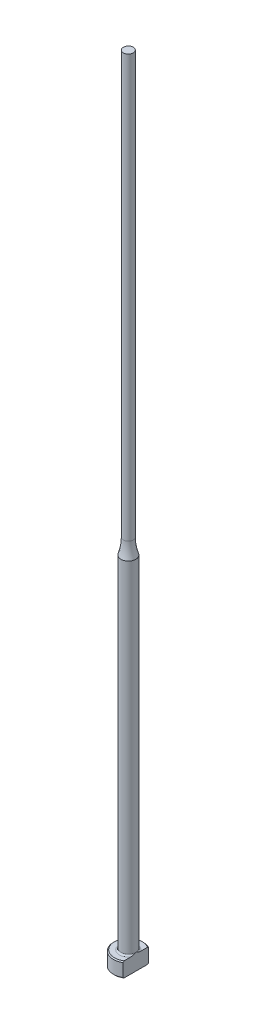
ISO-10303-21;
HEADER;
FILE_DESCRIPTION(('STEP AP214'),'2;1');
FILE_NAME('part.step','',(''),(''),'','','');
FILE_SCHEMA(('AUTOMOTIVE_DESIGN { 1 0 10303 214 1 1 1 1 }'));
ENDSEC;
DATA;
#1=APPLICATION_CONTEXT('core data for automotive mechanical design processes');
#2=APPLICATION_PROTOCOL_DEFINITION('international standard','automotive_design',2000,#1);
#3=PRODUCT_CONTEXT('',#1,'mechanical');
#4=PRODUCT('Part','Part','',(#3));
#5=PRODUCT_RELATED_PRODUCT_CATEGORY('part','',(#4));
#6=PRODUCT_DEFINITION_FORMATION('','',#4);
#7=PRODUCT_DEFINITION_CONTEXT('part definition',#1,'design');
#8=PRODUCT_DEFINITION('design','',#6,#7);
#9=PRODUCT_DEFINITION_SHAPE('','',#8);
#10=(LENGTH_UNIT() NAMED_UNIT(*) SI_UNIT(.MILLI.,.METRE.));
#11=(NAMED_UNIT(*) PLANE_ANGLE_UNIT() SI_UNIT($,.RADIAN.));
#12=(NAMED_UNIT(*) SI_UNIT($,.STERADIAN.) SOLID_ANGLE_UNIT());
#13=UNCERTAINTY_MEASURE_WITH_UNIT(LENGTH_MEASURE(1.E-05),#10,'distance_accuracy_value','');
#14=(GEOMETRIC_REPRESENTATION_CONTEXT(3) GLOBAL_UNCERTAINTY_ASSIGNED_CONTEXT((#13)) GLOBAL_UNIT_ASSIGNED_CONTEXT((#10,
#11,#12)) REPRESENTATION_CONTEXT('',''));
#15=CARTESIAN_POINT('',(0.,0.,0.));
#16=DIRECTION('',(0.,0.,1.));
#17=DIRECTION('',(1.,0.,0.));
#18=AXIS2_PLACEMENT_3D('',#15,#16,#17);
#19=CARTESIAN_POINT('',(-2.99999999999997,3.,0.));
#20=DIRECTION('',(0.,1.,0.));
#21=DIRECTION('',(0.,0.,1.));
#22=AXIS2_PLACEMENT_3D('',#19,#20,#21);
#23=PLANE('',#22);
#24=CARTESIAN_POINT('',(0.,3.,0.));
#25=DIRECTION('',(0.,1.,0.));
#26=DIRECTION('',(0.,0.,1.));
#27=AXIS2_PLACEMENT_3D('',#24,#25,#26);
#28=CIRCLE('',#27,2.79999999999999);
#29=CARTESIAN_POINT('',(1.49999999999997,3.,-2.36431808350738));
#30=VERTEX_POINT('',#29);
#31=CARTESIAN_POINT('',(1.49999999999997,3.,2.36431808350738));
#32=VERTEX_POINT('',#31);
#33=EDGE_CURVE('E187',#30,#32,#28,.T.);
#34=ORIENTED_EDGE('',*,*,#33,.T.);
#35=DIRECTION('',(0.,0.,-1.));
#36=VECTOR('',#35,1.);
#37=CARTESIAN_POINT('',(1.49999999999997,3.,0.));
#38=LINE('',#37,#36);
#39=CARTESIAN_POINT('',(1.49999999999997,3.00000000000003,0.99498743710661));
#40=VERTEX_POINT('',#39);
#41=EDGE_CURVE('E57',#32,#40,#38,.T.);
#42=ORIENTED_EDGE('',*,*,#41,.T.);
#43=CARTESIAN_POINT('',(0.,3.,0.));
#44=DIRECTION('',(0.,1.,0.));
#45=DIRECTION('',(0.,0.,1.));
#46=AXIS2_PLACEMENT_3D('',#43,#44,#45);
#47=CIRCLE('',#46,1.79999999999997);
#48=CARTESIAN_POINT('',(1.49999999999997,3.00000000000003,-0.994987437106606));
#49=VERTEX_POINT('',#48);
#50=EDGE_CURVE('E108',#40,#49,#47,.F.);
#51=ORIENTED_EDGE('',*,*,#50,.T.);
#52=EDGE_CURVE('E137',#49,#30,#38,.T.);
#53=ORIENTED_EDGE('',*,*,#52,.T.);
#54=EDGE_LOOP('',(#34,#42,#51,#53));
#55=FACE_BOUND('',#54,.T.);
#56=ADVANCED_FACE('F32',(#55),#23,.T.);
#57=CARTESIAN_POINT('',(0.,259.958771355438,0.));
#58=DIRECTION('',(0.,1.,0.));
#59=DIRECTION('',(0.,0.,1.));
#60=AXIS2_PLACEMENT_3D('',#57,#58,#59);
#61=CYLINDRICAL_SURFACE('',#60,2.99999999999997);
#62=CARTESIAN_POINT('',(0.,2.80000000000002,0.));
#63=DIRECTION('',(0.,1.,0.));
#64=DIRECTION('',(0.,0.,1.));
#65=AXIS2_PLACEMENT_3D('',#62,#63,#64);
#66=CIRCLE('',#65,2.99999999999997);
#67=CARTESIAN_POINT('',(1.49999999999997,2.80000000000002,2.5980762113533));
#68=VERTEX_POINT('',#67);
#69=CARTESIAN_POINT('',(1.49999999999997,2.80000000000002,-2.5980762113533));
#70=VERTEX_POINT('',#69);
#71=EDGE_CURVE('E105',#68,#70,#66,.F.);
#72=ORIENTED_EDGE('',*,*,#71,.T.);
#73=DIRECTION('',(0.,-1.,0.));
#74=VECTOR('',#73,1.);
#75=CARTESIAN_POINT('',(1.49999999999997,160.,-2.5980762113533));
#76=LINE('',#75,#74);
#77=CARTESIAN_POINT('',(1.49999999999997,0.200000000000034,-2.5980762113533));
#78=VERTEX_POINT('',#77);
#79=EDGE_CURVE('E193',#70,#78,#76,.T.);
#80=ORIENTED_EDGE('',*,*,#79,.T.);
#81=CARTESIAN_POINT('',(0.,0.200000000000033,0.));
#82=DIRECTION('',(0.,-1.,0.));
#83=DIRECTION('',(0.,0.,-1.));
#84=AXIS2_PLACEMENT_3D('',#81,#82,#83);
#85=CIRCLE('',#84,2.99999999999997);
#86=CARTESIAN_POINT('',(1.49999999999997,0.200000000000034,2.5980762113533));
#87=VERTEX_POINT('',#86);
#88=EDGE_CURVE('E100',#78,#87,#85,.F.);
#89=ORIENTED_EDGE('',*,*,#88,.T.);
#90=DIRECTION('',(0.,-1.,0.));
#91=VECTOR('',#90,1.);
#92=CARTESIAN_POINT('',(1.49999999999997,160.,2.5980762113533));
#93=LINE('',#92,#91);
#94=EDGE_CURVE('E93',#68,#87,#93,.T.);
#95=ORIENTED_EDGE('',*,*,#94,.F.);
#96=EDGE_LOOP('',(#72,#80,#89,#95));
#97=FACE_BOUND('',#96,.T.);
#98=ADVANCED_FACE('F158',(#97),#61,.T.);
#99=CARTESIAN_POINT('',(0.,0.,0.));
#100=DIRECTION('',(0.,-1.,0.));
#101=DIRECTION('',(0.,0.,-1.));
#102=AXIS2_PLACEMENT_3D('',#99,#100,#101);
#103=PLANE('',#102);
#104=CARTESIAN_POINT('',(0.,0.,0.));
#105=DIRECTION('',(0.,-1.,0.));
#106=DIRECTION('',(0.,0.,-1.));
#107=AXIS2_PLACEMENT_3D('',#104,#105,#106);
#108=CIRCLE('',#107,2.79999999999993);
#109=CARTESIAN_POINT('',(1.49999999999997,0.,2.36431808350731));
#110=VERTEX_POINT('',#109);
#111=CARTESIAN_POINT('',(1.49999999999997,0.,-2.36431808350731));
#112=VERTEX_POINT('',#111);
#113=EDGE_CURVE('E98',#110,#112,#108,.T.);
#114=ORIENTED_EDGE('',*,*,#113,.T.);
#115=DIRECTION('',(0.,0.,1.));
#116=VECTOR('',#115,1.);
#117=CARTESIAN_POINT('',(1.49999999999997,0.,-2.5980762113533));
#118=LINE('',#117,#116);
#119=EDGE_CURVE('E83',#112,#110,#118,.T.);
#120=ORIENTED_EDGE('',*,*,#119,.T.);
#121=EDGE_LOOP('',(#114,#120));
#122=FACE_BOUND('',#121,.T.);
#123=ADVANCED_FACE('F103',(#122),#103,.T.);
#124=CARTESIAN_POINT('',(0.,3.,0.));
#125=DIRECTION('',(0.,-1.,0.));
#126=DIRECTION('',(0.,0.,-1.));
#127=AXIS2_PLACEMENT_3D('',#124,#125,#126);
#128=CONICAL_SURFACE('',#127,2.79999999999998,0.785398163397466);
#129=ORIENTED_EDGE('',*,*,#71,.F.);
#130=CARTESIAN_POINT('',(1.49999999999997,-0.111741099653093,5.71827621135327));
#131=CARTESIAN_POINT('',(1.49999999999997,0.0136183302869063,5.58866816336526));
#132=CARTESIAN_POINT('',(1.49999999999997,0.138843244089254,5.45892957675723));
#133=CARTESIAN_POINT('',(1.49999999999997,0.388944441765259,5.19911365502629));
#134=CARTESIAN_POINT('',(1.49999999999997,0.513820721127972,5.06903631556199));
#135=CARTESIAN_POINT('',(1.49999999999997,0.763205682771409,4.80840180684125));
#136=CARTESIAN_POINT('',(1.49999999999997,0.887714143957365,4.67784442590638));
#137=CARTESIAN_POINT('',(1.49999999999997,1.13618059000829,4.41620813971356));
#138=CARTESIAN_POINT('',(1.49999999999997,1.26013857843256,4.28512923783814));
#139=CARTESIAN_POINT('',(1.49999999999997,1.50488975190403,4.02490837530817));
#140=CARTESIAN_POINT('',(1.49999999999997,1.6256969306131,3.89577958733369));
#141=CARTESIAN_POINT('',(1.49999999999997,1.86640694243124,3.63668213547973));
#142=CARTESIAN_POINT('',(1.49999999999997,1.98630978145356,3.50671347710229));
#143=CARTESIAN_POINT('',(1.49999999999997,2.22486033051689,3.24567921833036));
#144=CARTESIAN_POINT('',(1.49999999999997,2.34350830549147,3.11461386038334));
#145=CARTESIAN_POINT('',(1.49999999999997,2.57907716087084,2.85094268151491));
#146=CARTESIAN_POINT('',(1.49999999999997,2.69599811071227,2.71833692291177));
#147=CARTESIAN_POINT('',(1.49999999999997,2.88262371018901,2.50255231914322));
#148=CARTESIAN_POINT('',(1.49999999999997,2.95312454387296,2.42006293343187));
#149=CARTESIAN_POINT('',(1.49999999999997,3.0928709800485,2.25401084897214));
#150=CARTESIAN_POINT('',(1.49999999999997,3.16211645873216,2.17044804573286));
#151=CARTESIAN_POINT('',(1.49999999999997,3.29964684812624,2.00105967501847));
#152=CARTESIAN_POINT('',(1.49999999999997,3.36791386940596,1.91521952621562));
#153=CARTESIAN_POINT('',(1.49999999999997,3.50205840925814,1.74171392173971));
#154=CARTESIAN_POINT('',(1.49999999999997,3.56793649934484,1.65404891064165));
#155=CARTESIAN_POINT('',(1.49999999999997,3.69728151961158,1.47490236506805));
#156=CARTESIAN_POINT('',(1.49999999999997,3.76069661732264,1.38338308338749));
#157=CARTESIAN_POINT('',(1.49999999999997,3.8823953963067,1.19675661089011));
#158=CARTESIAN_POINT('',(1.49999999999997,3.94067201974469,1.10164473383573));
#159=CARTESIAN_POINT('',(1.49999999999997,4.04841325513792,0.908008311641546));
#160=CARTESIAN_POINT('',(1.49999999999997,4.0979780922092,0.809540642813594));
#161=CARTESIAN_POINT('',(1.49999999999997,4.18432188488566,0.607192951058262));
#162=CARTESIAN_POINT('',(1.49999999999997,4.22114374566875,0.503332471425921));
#163=CARTESIAN_POINT('',(1.49999999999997,4.26099935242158,0.347577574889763));
#164=CARTESIAN_POINT('',(1.49999999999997,4.27157029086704,0.297609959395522));
#165=CARTESIAN_POINT('',(1.49999999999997,4.28794860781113,0.196885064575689));
#166=CARTESIAN_POINT('',(1.49999999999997,4.29375640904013,0.146127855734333));
#167=CARTESIAN_POINT('',(1.49999999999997,4.30019707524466,0.0444388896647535));
#168=CARTESIAN_POINT('',(1.49999999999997,4.30084594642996,-0.00649183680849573));
#169=CARTESIAN_POINT('',(1.49999999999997,4.29696416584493,-0.108155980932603));
#170=CARTESIAN_POINT('',(1.49999999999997,4.29243308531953,-0.15888938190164));
#171=CARTESIAN_POINT('',(1.49999999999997,4.27856915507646,-0.259234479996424));
#172=CARTESIAN_POINT('',(1.49999999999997,4.26927821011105,-0.30885208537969));
#173=CARTESIAN_POINT('',(1.49999999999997,4.24647108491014,-0.407110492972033));
#174=CARTESIAN_POINT('',(1.49999999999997,4.2329532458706,-0.455750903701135));
#175=CARTESIAN_POINT('',(1.49999999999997,4.20226175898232,-0.552149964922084));
#176=CARTESIAN_POINT('',(1.49999999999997,4.18506801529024,-0.599902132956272));
#177=CARTESIAN_POINT('',(1.49999999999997,4.14771387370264,-0.694205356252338));
#178=CARTESIAN_POINT('',(1.49999999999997,4.1275540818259,-0.740756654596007));
#179=CARTESIAN_POINT('',(1.49999999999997,4.06327696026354,-0.879166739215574));
#180=CARTESIAN_POINT('',(1.49999999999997,4.01551721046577,-0.969329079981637));
#181=CARTESIAN_POINT('',(1.49999999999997,3.91367909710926,-1.1460431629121));
#182=CARTESIAN_POINT('',(1.49999999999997,3.85959300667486,-1.23259031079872));
#183=CARTESIAN_POINT('',(1.49999999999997,3.74697968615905,-1.40321348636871));
#184=CARTESIAN_POINT('',(1.49999999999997,3.68843573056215,-1.48727838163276));
#185=CARTESIAN_POINT('',(1.49999999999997,3.56843845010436,-1.65322187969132));
#186=CARTESIAN_POINT('',(1.49999999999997,3.50698656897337,-1.73510153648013));
#187=CARTESIAN_POINT('',(1.49999999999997,3.38115673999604,-1.89829823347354));
#188=CARTESIAN_POINT('',(1.49999999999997,3.31675092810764,-1.97959369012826));
#189=CARTESIAN_POINT('',(1.49999999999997,3.18634068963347,-2.14090082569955));
#190=CARTESIAN_POINT('',(1.49999999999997,3.12033609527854,-2.22091236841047));
#191=CARTESIAN_POINT('',(1.49999999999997,2.92086431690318,-2.45906508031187));
#192=CARTESIAN_POINT('',(1.49999999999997,2.78562663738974,-2.61572090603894));
#193=CARTESIAN_POINT('',(1.49999999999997,2.53554498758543,-2.90006295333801));
#194=CARTESIAN_POINT('',(1.49999999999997,2.42114543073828,-3.02814382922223));
#195=CARTESIAN_POINT('',(1.49999999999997,2.19093557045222,-3.28303767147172));
#196=CARTESIAN_POINT('',(1.49999999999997,2.07512522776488,-3.40985060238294));
#197=CARTESIAN_POINT('',(1.49999999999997,1.72597067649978,-3.7891384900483));
#198=CARTESIAN_POINT('',(1.49999999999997,1.49111760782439,-4.04022177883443));
#199=CARTESIAN_POINT('',(1.49999999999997,1.02882478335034,-4.52992803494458));
#200=CARTESIAN_POINT('',(1.49999999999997,0.801477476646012,-4.76863870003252));
#201=CARTESIAN_POINT('',(1.49999999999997,0.459548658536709,-5.12558036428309));
#202=CARTESIAN_POINT('',(1.49999999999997,0.345484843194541,-5.2443077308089));
#203=CARTESIAN_POINT('',(1.49999999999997,0.117071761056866,-5.48148573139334));
#204=CARTESIAN_POINT('',(1.49999999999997,0.00272249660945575,-5.59993636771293));
#205=CARTESIAN_POINT('',(1.49999999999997,-0.111741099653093,-5.71827621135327));
#206=B_SPLINE_CURVE_WITH_KNOTS('',3,(#130,#131,#132,#133,#134,#135,#136,#137,#138,#139,#140,
#141,#142,#143,#144,#145,#146,#147,#148,#149,#150,#151,#152,#153,#154,#155,#156,#157,#158,#159,
#160,#161,#162,#163,#164,#165,#166,#167,#168,#169,#170,#171,#172,#173,#174,#175,#176,#177,#178,
#179,#180,#181,#182,#183,#184,#185,#186,#187,#188,#189,#190,#191,#192,#193,#194,#195,#196,#197,
#198,#199,#200,#201,#202,#203,#204,#205),.UNSPECIFIED.,.F.,.F.,(4,2,2,2,2,2,2,2,2,2,2,2,2,2,2,2,
2,2,2,2,2,2,2,2,2,2,2,2,2,2,2,2,2,2,2,2,2,4),(0.,0.540943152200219,1.08189327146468,
1.62312052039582,2.16434426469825,2.69482920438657,3.22531067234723,3.75567781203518,
4.2860235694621,4.61155053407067,4.93710943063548,5.2661094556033,5.59503024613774,
5.92894782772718,6.26331713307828,6.59354403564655,6.92264800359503,7.0756747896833,
7.22868799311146,7.38122626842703,7.53377717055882,7.68500755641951,7.83629736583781,
7.98843643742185,8.14054446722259,8.44618799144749,8.75220879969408,9.05944044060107,
9.36652111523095,9.67764287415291,9.98879742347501,10.6095925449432,11.1247803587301,
11.6399825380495,12.6713544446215,13.6603005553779,14.1542238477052,14.6481430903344),.UNSPECIFIED.);
#207=EDGE_CURVE('E136',#68,#32,#206,.T.);
#208=ORIENTED_EDGE('',*,*,#207,.T.);
#209=ORIENTED_EDGE('',*,*,#33,.F.);
#210=EDGE_CURVE('E128',#30,#70,#206,.T.);
#211=ORIENTED_EDGE('',*,*,#210,.T.);
#212=EDGE_LOOP('',(#129,#208,#209,#211));
#213=FACE_BOUND('',#212,.T.);
#214=ADVANCED_FACE('F144',(#213),#128,.T.);
#215=CARTESIAN_POINT('',(0.,0.200000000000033,0.));
#216=DIRECTION('',(0.,1.,0.));
#217=DIRECTION('',(0.,0.,1.));
#218=AXIS2_PLACEMENT_3D('',#215,#216,#217);
#219=CONICAL_SURFACE('',#218,2.99999999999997,0.785398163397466);
#220=ORIENTED_EDGE('',*,*,#88,.F.);
#221=CARTESIAN_POINT('',(1.49999999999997,3.11174109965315,-5.71827621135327));
#222=CARTESIAN_POINT('',(1.49999999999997,2.98638166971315,-5.58866816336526));
#223=CARTESIAN_POINT('',(1.49999999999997,2.8611567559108,-5.45892957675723));
#224=CARTESIAN_POINT('',(1.49999999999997,2.6110555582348,-5.19911365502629));
#225=CARTESIAN_POINT('',(1.49999999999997,2.48617927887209,-5.06903631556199));
#226=CARTESIAN_POINT('',(1.49999999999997,2.23679431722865,-4.80840180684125));
#227=CARTESIAN_POINT('',(1.49999999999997,2.11228585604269,-4.67784442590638));
#228=CARTESIAN_POINT('',(1.49999999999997,1.86381940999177,-4.41620813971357));
#229=CARTESIAN_POINT('',(1.49999999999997,1.7398614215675,-4.28512923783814));
#230=CARTESIAN_POINT('',(1.49999999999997,1.49511024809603,-4.02490837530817));
#231=CARTESIAN_POINT('',(1.49999999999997,1.37430306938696,-3.89577958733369));
#232=CARTESIAN_POINT('',(1.49999999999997,1.13359305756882,-3.63668213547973));
#233=CARTESIAN_POINT('',(1.49999999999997,1.0136902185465,-3.50671347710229));
#234=CARTESIAN_POINT('',(1.49999999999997,0.775139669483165,-3.24567921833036));
#235=CARTESIAN_POINT('',(1.49999999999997,0.656491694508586,-3.11461386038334));
#236=CARTESIAN_POINT('',(1.49999999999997,0.420922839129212,-2.85094268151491));
#237=CARTESIAN_POINT('',(1.49999999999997,0.304001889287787,-2.71833692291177));
#238=CARTESIAN_POINT('',(1.49999999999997,0.117376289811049,-2.50255231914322));
#239=CARTESIAN_POINT('',(1.49999999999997,0.0468754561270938,-2.42006293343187));
#240=CARTESIAN_POINT('',(1.49999999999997,-0.0928709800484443,-2.25401084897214));
#241=CARTESIAN_POINT('',(1.49999999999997,-0.162116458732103,-2.17044804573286));
#242=CARTESIAN_POINT('',(1.49999999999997,-0.299646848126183,-2.00105967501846));
#243=CARTESIAN_POINT('',(1.49999999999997,-0.367913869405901,-1.91521952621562));
#244=CARTESIAN_POINT('',(1.49999999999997,-0.502058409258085,-1.74171392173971));
#245=CARTESIAN_POINT('',(1.49999999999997,-0.567936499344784,-1.65404891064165));
#246=CARTESIAN_POINT('',(1.49999999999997,-0.697281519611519,-1.47490236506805));
#247=CARTESIAN_POINT('',(1.49999999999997,-0.760696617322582,-1.38338308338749));
#248=CARTESIAN_POINT('',(1.49999999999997,-0.882395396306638,-1.19675661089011));
#249=CARTESIAN_POINT('',(1.49999999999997,-0.940672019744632,-1.10164473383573));
#250=CARTESIAN_POINT('',(1.49999999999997,-1.04841325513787,-0.908008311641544));
#251=CARTESIAN_POINT('',(1.49999999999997,-1.09797809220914,-0.809540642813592));
#252=CARTESIAN_POINT('',(1.49999999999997,-1.1843218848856,-0.60719295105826));
#253=CARTESIAN_POINT('',(1.49999999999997,-1.22114374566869,-0.503332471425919));
#254=CARTESIAN_POINT('',(1.49999999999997,-1.26099935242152,-0.347577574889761));
#255=CARTESIAN_POINT('',(1.49999999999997,-1.27157029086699,-0.29760995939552));
#256=CARTESIAN_POINT('',(1.49999999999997,-1.28794860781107,-0.196885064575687));
#257=CARTESIAN_POINT('',(1.49999999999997,-1.29375640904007,-0.146127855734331));
#258=CARTESIAN_POINT('',(1.49999999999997,-1.30019707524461,-0.0444388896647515));
#259=CARTESIAN_POINT('',(1.49999999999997,-1.3008459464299,0.00649183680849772));
#260=CARTESIAN_POINT('',(1.49999999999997,-1.29696416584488,0.108155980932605));
#261=CARTESIAN_POINT('',(1.49999999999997,-1.29243308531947,0.158889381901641));
#262=CARTESIAN_POINT('',(1.49999999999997,-1.2785691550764,0.259234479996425));
#263=CARTESIAN_POINT('',(1.49999999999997,-1.26927821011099,0.308852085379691));
#264=CARTESIAN_POINT('',(1.49999999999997,-1.24647108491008,0.407110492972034));
#265=CARTESIAN_POINT('',(1.49999999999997,-1.23295324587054,0.455750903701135));
#266=CARTESIAN_POINT('',(1.49999999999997,-1.20226175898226,0.552149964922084));
#267=CARTESIAN_POINT('',(1.49999999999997,-1.18506801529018,0.599902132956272));
#268=CARTESIAN_POINT('',(1.49999999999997,-1.14771387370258,0.694205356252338));
#269=CARTESIAN_POINT('',(1.49999999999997,-1.12755408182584,0.740756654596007));
#270=CARTESIAN_POINT('',(1.49999999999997,-1.06327696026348,0.879166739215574));
#271=CARTESIAN_POINT('',(1.49999999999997,-1.01551721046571,0.969329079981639));
#272=CARTESIAN_POINT('',(1.49999999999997,-0.913679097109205,1.1460431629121));
#273=CARTESIAN_POINT('',(1.49999999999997,-0.8595930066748,1.23259031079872));
#274=CARTESIAN_POINT('',(1.49999999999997,-0.746979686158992,1.40321348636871));
#275=CARTESIAN_POINT('',(1.49999999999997,-0.688435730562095,1.48727838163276));
#276=CARTESIAN_POINT('',(1.49999999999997,-0.568438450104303,1.65322187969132));
#277=CARTESIAN_POINT('',(1.49999999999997,-0.506986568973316,1.73510153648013));
#278=CARTESIAN_POINT('',(1.49999999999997,-0.381156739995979,1.89829823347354));
#279=CARTESIAN_POINT('',(1.49999999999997,-0.316750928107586,1.97959369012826));
#280=CARTESIAN_POINT('',(1.49999999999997,-0.186340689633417,2.14090082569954));
#281=CARTESIAN_POINT('',(1.49999999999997,-0.120336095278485,2.22091236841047));
#282=CARTESIAN_POINT('',(1.49999999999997,0.0791356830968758,2.45906508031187));
#283=CARTESIAN_POINT('',(1.49999999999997,0.214373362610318,2.61572090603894));
#284=CARTESIAN_POINT('',(1.49999999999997,0.46445501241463,2.90006295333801));
#285=CARTESIAN_POINT('',(1.49999999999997,0.578854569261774,3.02814382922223));
#286=CARTESIAN_POINT('',(1.49999999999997,0.809064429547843,3.28303767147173));
#287=CARTESIAN_POINT('',(1.49999999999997,0.924874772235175,3.40985060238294));
#288=CARTESIAN_POINT('',(1.49999999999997,1.27402932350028,3.78913849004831));
#289=CARTESIAN_POINT('',(1.49999999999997,1.50888239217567,4.04022177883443));
#290=CARTESIAN_POINT('',(1.49999999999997,1.97117521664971,4.52992803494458));
#291=CARTESIAN_POINT('',(1.49999999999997,2.19852252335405,4.76863870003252));
#292=CARTESIAN_POINT('',(1.49999999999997,2.54045134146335,5.12558036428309));
#293=CARTESIAN_POINT('',(1.49999999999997,2.65451515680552,5.2443077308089));
#294=CARTESIAN_POINT('',(1.49999999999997,2.88292823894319,5.48148573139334));
#295=CARTESIAN_POINT('',(1.49999999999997,2.9972775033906,5.59993636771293));
#296=CARTESIAN_POINT('',(1.49999999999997,3.11174109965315,5.71827621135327));
#297=B_SPLINE_CURVE_WITH_KNOTS('',3,(#221,#222,#223,#224,#225,#226,#227,#228,#229,#230,#231,
#232,#233,#234,#235,#236,#237,#238,#239,#240,#241,#242,#243,#244,#245,#246,#247,#248,#249,#250,
#251,#252,#253,#254,#255,#256,#257,#258,#259,#260,#261,#262,#263,#264,#265,#266,#267,#268,#269,
#270,#271,#272,#273,#274,#275,#276,#277,#278,#279,#280,#281,#282,#283,#284,#285,#286,#287,#288,
#289,#290,#291,#292,#293,#294,#295,#296),.UNSPECIFIED.,.F.,.F.,(4,2,2,2,2,2,2,2,2,2,2,2,2,2,2,2,
2,2,2,2,2,2,2,2,2,2,2,2,2,2,2,2,2,2,2,2,2,4),(0.,0.540943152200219,1.08189327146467,
1.62312052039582,2.16434426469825,2.69482920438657,3.22531067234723,3.75567781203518,
4.28602356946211,4.61155053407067,4.93710943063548,5.2661094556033,5.59503024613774,
5.92894782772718,6.26331713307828,6.59354403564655,6.92264800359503,7.0756747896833,
7.22868799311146,7.38122626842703,7.53377717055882,7.68500755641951,7.83629736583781,
7.98843643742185,8.14054446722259,8.4461879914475,8.75220879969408,9.05944044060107,
9.36652111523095,9.6776428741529,9.98879742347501,10.6095925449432,11.1247803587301,
11.6399825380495,12.6713544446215,13.6603005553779,14.1542238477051,14.6481430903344),.UNSPECIFIED.);
#298=EDGE_CURVE('E86',#78,#112,#297,.T.);
#299=ORIENTED_EDGE('',*,*,#298,.T.);
#300=ORIENTED_EDGE('',*,*,#113,.F.);
#301=EDGE_CURVE('E89',#110,#87,#297,.T.);
#302=ORIENTED_EDGE('',*,*,#301,.T.);
#303=EDGE_LOOP('',(#220,#299,#300,#302));
#304=FACE_BOUND('',#303,.T.);
#305=ADVANCED_FACE('F97',(#304),#219,.T.);
#306=CARTESIAN_POINT('',(0.,3.30000000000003,0.));
#307=DIRECTION('',(0.,1.,0.));
#308=DIRECTION('',(0.,0.,1.));
#309=AXIS2_PLACEMENT_3D('',#306,#307,#308);
#310=TOROIDAL_SURFACE('',#309,1.79999999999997,0.3);
#311=CARTESIAN_POINT('',(1.49999999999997,3.30000000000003,0.));
#312=CARTESIAN_POINT('',(1.49999999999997,3.300000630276,3.41555678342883E-12));
#313=CARTESIAN_POINT('',(1.49999999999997,3.30000126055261,-1.15373640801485E-07));
#314=CARTESIAN_POINT('',(1.49999999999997,3.3000024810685,-4.90631575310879E-07));
#315=CARTESIAN_POINT('',(1.49999999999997,3.30000307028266,-7.53296670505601E-07));
#316=CARTESIAN_POINT('',(1.49999999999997,3.30000424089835,-1.38757096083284E-06));
#317=CARTESIAN_POINT('',(1.49999999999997,3.300004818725,-1.76563001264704E-06));
#318=CARTESIAN_POINT('',(1.49999999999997,3.30000591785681,-2.58768006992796E-06));
#319=CARTESIAN_POINT('',(1.49999999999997,3.30000643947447,-3.03127014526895E-06));
#320=CARTESIAN_POINT('',(1.49999999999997,3.30000815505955,-4.60021967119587E-06));
#321=CARTESIAN_POINT('',(1.49999999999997,3.30000927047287,-5.8124152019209E-06));
#322=CARTESIAN_POINT('',(1.49999999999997,3.30001128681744,-8.33989413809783E-06));
#323=CARTESIAN_POINT('',(1.49999999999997,3.30001219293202,-9.65128157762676E-06));
#324=CARTESIAN_POINT('',(1.49999999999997,3.30001551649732,-1.46782505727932E-05));
#325=CARTESIAN_POINT('',(1.49999999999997,3.30001775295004,-1.8517976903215E-05));
#326=CARTESIAN_POINT('',(1.49999999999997,3.30002148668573,-2.61616194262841E-05));
#327=CARTESIAN_POINT('',(1.49999999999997,3.30002302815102,-2.99447742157E-05));
#328=CARTESIAN_POINT('',(1.49999999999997,3.30002943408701,-4.58003743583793E-05));
#329=CARTESIAN_POINT('',(1.49999999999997,3.3000341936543,-5.79079078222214E-05));
#330=CARTESIAN_POINT('',(1.49999999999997,3.30004197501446,-8.07263755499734E-05));
#331=CARTESIAN_POINT('',(1.49999999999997,3.30004514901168,-9.13834709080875E-05));
#332=CARTESIAN_POINT('',(1.49999999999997,3.30006989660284,-0.000167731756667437));
#333=CARTESIAN_POINT('',(1.49999999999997,3.30010092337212,-0.000229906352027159));
#334=CARTESIAN_POINT('',(1.49999999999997,3.30021632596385,-0.000470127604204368));
#335=CARTESIAN_POINT('',(1.49999999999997,3.30029368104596,-0.000650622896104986));
#336=CARTESIAN_POINT('',(1.49999999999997,3.30059619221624,-0.00134589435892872));
#337=CARTESIAN_POINT('',(1.49999999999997,3.30082870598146,-0.00185814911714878));
#338=CARTESIAN_POINT('',(1.49999999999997,3.30176696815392,-0.00393547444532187));
#339=CARTESIAN_POINT('',(1.49999999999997,3.30246445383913,-0.00550332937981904));
#340=CARTESIAN_POINT('',(1.49999999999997,3.31426785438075,-0.0320229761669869));
#341=CARTESIAN_POINT('',(1.49999999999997,3.32544800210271,-0.0569503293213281));
#342=CARTESIAN_POINT('',(1.49999999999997,3.34725700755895,-0.105984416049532));
#343=CARTESIAN_POINT('',(1.49999999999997,3.35789134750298,-0.130088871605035));
#344=CARTESIAN_POINT('',(1.49999999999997,3.38015321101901,-0.181096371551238));
#345=CARTESIAN_POINT('',(1.49999999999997,3.39175804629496,-0.208009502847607));
#346=CARTESIAN_POINT('',(1.49999999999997,3.41469034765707,-0.262264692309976));
#347=CARTESIAN_POINT('',(1.49999999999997,3.42601398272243,-0.289608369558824));
#348=CARTESIAN_POINT('',(1.49999999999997,3.45363212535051,-0.35820378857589));
#349=CARTESIAN_POINT('',(1.49999999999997,3.46959026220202,-0.39959288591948));
#350=CARTESIAN_POINT('',(1.49999999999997,3.49940505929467,-0.482097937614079));
#351=CARTESIAN_POINT('',(1.49999999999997,3.51330033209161,-0.523199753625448));
#352=CARTESIAN_POINT('',(1.49999999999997,3.53552507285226,-0.595497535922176));
#353=CARTESIAN_POINT('',(1.49999999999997,3.54436834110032,-0.626532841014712));
#354=CARTESIAN_POINT('',(1.49999999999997,3.56052427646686,-0.6891760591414));
#355=CARTESIAN_POINT('',(1.49999999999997,3.5678279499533,-0.720786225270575));
#356=CARTESIAN_POINT('',(1.49999999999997,3.5875075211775,-0.819524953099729));
#357=CARTESIAN_POINT('',(1.49999999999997,3.59661044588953,-0.88742909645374));
#358=CARTESIAN_POINT('',(1.49999999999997,3.60059842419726,-0.991180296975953));
#359=CARTESIAN_POINT('',(1.49999999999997,3.60019840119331,-1.02684364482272));
#360=CARTESIAN_POINT('',(1.49999999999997,3.59497085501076,-1.097505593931));
#361=CARTESIAN_POINT('',(1.49999999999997,3.59019295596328,-1.13250716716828));
#362=CARTESIAN_POINT('',(1.49999999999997,3.57687734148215,-1.19353096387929));
#363=CARTESIAN_POINT('',(1.49999999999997,3.56943875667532,-1.21978854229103));
#364=CARTESIAN_POINT('',(1.49999999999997,3.55063748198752,-1.27094658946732));
#365=CARTESIAN_POINT('',(1.49999999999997,3.53927342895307,-1.29584658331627));
#366=CARTESIAN_POINT('',(1.49999999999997,3.51660016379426,-1.33501873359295));
#367=CARTESIAN_POINT('',(1.49999999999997,3.50657738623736,-1.35003296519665));
#368=CARTESIAN_POINT('',(1.49999999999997,3.48437469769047,-1.37837252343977));
#369=CARTESIAN_POINT('',(1.49999999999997,3.47219867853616,-1.39170082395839));
#370=CARTESIAN_POINT('',(1.49999999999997,3.44835614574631,-1.41349417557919));
#371=CARTESIAN_POINT('',(1.49999999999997,3.43709185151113,-1.42239673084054));
#372=CARTESIAN_POINT('',(1.49999999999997,3.41325256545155,-1.43825467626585));
#373=CARTESIAN_POINT('',(1.49999999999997,3.40067804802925,-1.44521076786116));
#374=CARTESIAN_POINT('',(1.49999999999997,3.37433767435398,-1.45677158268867));
#375=CARTESIAN_POINT('',(1.49999999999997,3.36056203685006,-1.46135438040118));
#376=CARTESIAN_POINT('',(1.49999999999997,3.33237324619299,-1.46767730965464));
#377=CARTESIAN_POINT('',(1.49999999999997,3.31796076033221,-1.46942034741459));
#378=CARTESIAN_POINT('',(1.49999999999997,3.29122479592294,-1.4698720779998));
#379=CARTESIAN_POINT('',(1.49999999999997,3.27890664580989,-1.468990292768));
#380=CARTESIAN_POINT('',(1.49999999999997,3.25461019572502,-1.4651157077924));
#381=CARTESIAN_POINT('',(1.49999999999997,3.2426318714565,-1.46212305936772));
#382=CARTESIAN_POINT('',(1.49999999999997,3.21959683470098,-1.4543117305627));
#383=CARTESIAN_POINT('',(1.49999999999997,3.20852542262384,-1.44953579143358));
#384=CARTESIAN_POINT('',(1.49999999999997,3.18721125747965,-1.43840957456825));
#385=CARTESIAN_POINT('',(1.49999999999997,3.1769687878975,-1.43205876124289));
#386=CARTESIAN_POINT('',(1.49999999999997,3.15325976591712,-1.41506353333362));
#387=CARTESIAN_POINT('',(1.49999999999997,3.14027750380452,-1.40374235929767));
#388=CARTESIAN_POINT('',(1.49999999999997,3.11630720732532,-1.37914825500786));
#389=CARTESIAN_POINT('',(1.49999999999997,3.10532420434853,-1.36587054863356));
#390=CARTESIAN_POINT('',(1.49999999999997,3.08100891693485,-1.33197272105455));
#391=CARTESIAN_POINT('',(1.49999999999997,3.06867625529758,-1.31063843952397));
#392=CARTESIAN_POINT('',(1.49999999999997,3.04751867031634,-1.26637455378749));
#393=CARTESIAN_POINT('',(1.49999999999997,3.03869240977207,-1.24344556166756));
#394=CARTESIAN_POINT('',(1.49999999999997,3.01978360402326,-1.18316534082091));
#395=CARTESIAN_POINT('',(1.49999999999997,3.01191472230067,-1.14512623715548));
#396=CARTESIAN_POINT('',(1.49999999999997,3.00188285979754,-1.06789971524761));
#397=CARTESIAN_POINT('',(1.49999999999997,2.99979735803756,-1.02870374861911));
#398=CARTESIAN_POINT('',(1.49999999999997,3.00021727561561,-0.953160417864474));
#399=CARTESIAN_POINT('',(1.49999999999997,3.00240673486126,-0.916808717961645));
#400=CARTESIAN_POINT('',(1.49999999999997,3.0099643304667,-0.844432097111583));
#401=CARTESIAN_POINT('',(1.49999999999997,3.01533462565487,-0.808407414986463));
#402=CARTESIAN_POINT('',(1.49999999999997,3.02828086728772,-0.738670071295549));
#403=CARTESIAN_POINT('',(1.49999999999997,3.03573028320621,-0.704933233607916));
#404=CARTESIAN_POINT('',(1.49999999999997,3.05243174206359,-0.638128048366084));
#405=CARTESIAN_POINT('',(1.49999999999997,3.06167285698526,-0.605056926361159));
#406=CARTESIAN_POINT('',(1.49999999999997,3.08440652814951,-0.53019513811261));
#407=CARTESIAN_POINT('',(1.49999999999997,3.09836576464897,-0.488547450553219));
#408=CARTESIAN_POINT('',(1.49999999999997,3.1283820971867,-0.404954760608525));
#409=CARTESIAN_POINT('',(1.49999999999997,3.14447968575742,-0.363024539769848));
#410=CARTESIAN_POINT('',(1.49999999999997,3.17238454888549,-0.293508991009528));
#411=CARTESIAN_POINT('',(1.49999999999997,3.18384249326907,-0.265781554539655));
#412=CARTESIAN_POINT('',(1.49999999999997,3.20705854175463,-0.210769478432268));
#413=CARTESIAN_POINT('',(1.49999999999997,3.21881265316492,-0.183483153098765));
#414=CARTESIAN_POINT('',(1.49999999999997,3.24136702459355,-0.131772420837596));
#415=CARTESIAN_POINT('',(1.49999999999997,3.25214361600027,-0.107337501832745));
#416=CARTESIAN_POINT('',(1.49999999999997,3.27424746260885,-0.0576321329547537));
#417=CARTESIAN_POINT('',(1.49999999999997,3.28558038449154,-0.0323640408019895));
#418=CARTESIAN_POINT('',(1.49999999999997,3.29753556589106,-0.00550327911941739));
#419=CARTESIAN_POINT('',(1.49999999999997,3.29823307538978,-0.00393537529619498));
#420=CARTESIAN_POINT('',(1.49999999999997,3.29917134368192,-0.00185803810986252));
#421=CARTESIAN_POINT('',(1.49999999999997,3.29940384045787,-0.00134582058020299));
#422=CARTESIAN_POINT('',(1.49999999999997,3.29970633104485,-0.000650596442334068));
#423=CARTESIAN_POINT('',(1.49999999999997,3.29978368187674,-0.000470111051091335));
#424=CARTESIAN_POINT('',(1.49999999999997,3.29989907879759,-0.000229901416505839));
#425=CARTESIAN_POINT('',(1.49999999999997,3.29993010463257,-0.000167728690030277));
#426=CARTESIAN_POINT('',(1.49999999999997,3.29995485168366,-9.13825689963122E-05));
#427=CARTESIAN_POINT('',(1.49999999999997,3.29995802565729,-8.07256241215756E-05));
#428=CARTESIAN_POINT('',(1.49999999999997,3.29996580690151,-5.79074820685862E-05));
#429=CARTESIAN_POINT('',(1.49999999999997,3.29997056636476,-4.5800119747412E-05));
#430=CARTESIAN_POINT('',(1.49999999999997,3.29997697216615,-2.99447119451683E-05));
#431=CARTESIAN_POINT('',(1.49999999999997,3.2999785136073,-2.61615817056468E-05));
#432=CARTESIAN_POINT('',(1.49999999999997,3.2999822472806,-1.85179845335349E-05));
#433=CARTESIAN_POINT('',(1.49999999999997,3.29998448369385,-1.46782782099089E-05));
#434=CARTESIAN_POINT('',(1.49999999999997,3.2999878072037,-9.65132752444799E-06));
#435=CARTESIAN_POINT('',(1.49999999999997,3.299988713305,-8.33994202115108E-06));
#436=CARTESIAN_POINT('',(1.49999999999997,3.29999072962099,-5.81246426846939E-06));
#437=CARTESIAN_POINT('',(1.49999999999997,3.29999184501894,-4.600267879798E-06));
#438=CARTESIAN_POINT('',(1.49999999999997,3.29999356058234,-3.03131394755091E-06));
#439=CARTESIAN_POINT('',(1.49999999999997,3.29999408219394,-2.58772196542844E-06));
#440=CARTESIAN_POINT('',(1.49999999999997,3.2999951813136,-1.76566701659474E-06));
#441=CARTESIAN_POINT('',(1.49999999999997,3.29999575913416,-1.38760497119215E-06));
#442=CARTESIAN_POINT('',(1.49999999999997,3.29999692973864,-7.53323425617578E-07));
#443=CARTESIAN_POINT('',(1.49999999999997,3.29999751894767,-4.90654189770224E-07));
#444=CARTESIAN_POINT('',(1.49999999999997,3.29999873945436,-1.15386267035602E-07));
#445=CARTESIAN_POINT('',(1.49999999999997,3.29999936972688,-3.41554144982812E-12));
#446=CARTESIAN_POINT('',(1.49999999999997,3.30000000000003,0.));
#447=B_SPLINE_CURVE_WITH_KNOTS('',3,(#311,#312,#313,#314,#315,#316,#317,#318,#319,#320,#321,
#322,#323,#324,#325,#326,#327,#328,#329,#330,#331,#332,#333,#334,#335,#336,#337,#338,#339,#340,
#341,#342,#343,#344,#345,#346,#347,#348,#349,#350,#351,#352,#353,#354,#355,#356,#357,#358,#359,
#360,#361,#362,#363,#364,#365,#366,#367,#368,#369,#370,#371,#372,#373,#374,#375,#376,#377,#378,
#379,#380,#381,#382,#383,#384,#385,#386,#387,#388,#389,#390,#391,#392,#393,#394,#395,#396,#397,
#398,#399,#400,#401,#402,#403,#404,#405,#406,#407,#408,#409,#410,#411,#412,#413,#414,#415,#416,
#417,#418,#419,#420,#421,#422,#423,#424,#425,#426,#427,#428,#429,#430,#431,#432,#433,#434,#435,
#436,#437,#438,#439,#440,#441,#442,#443,#444,#445,#446),.UNSPECIFIED.,.T.,.F.,(4,2,2,2,2,2,2,2,
2,2,2,2,2,2,2,2,2,2,2,2,2,2,2,2,2,2,2,2,2,2,2,2,2,2,2,2,2,2,2,2,2,2,2,2,2,2,2,2,2,2,2,2,2,2,2,2,
2,2,2,2,2,2,2,2,2,2,2,4),(0.,1.88906036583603E-06,3.8150959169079E-06,5.87892837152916E-06,
7.93062024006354E-06,1.28480890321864E-05,1.76261717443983E-05,3.0909918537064E-05,
4.31529750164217E-05,8.21699329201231E-05,0.000115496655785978,0.000323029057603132,
0.000912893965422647,0.00259963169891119,0.00774858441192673,0.0896975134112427,
0.168737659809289,0.256660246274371,0.345444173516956,0.478492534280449,0.608603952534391,
0.705372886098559,0.802692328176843,1.00719557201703,1.11399616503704,1.21960092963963,
1.30124317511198,1.38291380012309,1.43690814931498,1.49080588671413,1.53371524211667,
1.57660911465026,1.61989249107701,1.66313154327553,1.69999492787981,1.73685567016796,
1.77288440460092,1.80892540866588,1.86031324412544,1.91182866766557,1.98534297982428,
2.05882922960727,2.1747172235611,2.29215041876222,2.40123170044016,2.51038710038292,
2.613972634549,2.71694519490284,2.84866234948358,2.98337525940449,3.07337666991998,
3.16250453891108,3.24262397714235,3.32569301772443,3.3308421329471,3.33252874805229,
3.33311858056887,3.33332610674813,3.33335943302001,3.33339844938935,3.3334106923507,
3.33342397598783,3.33342875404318,3.33343367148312,3.33343572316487,3.33343778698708,
3.33343971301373,3.33344160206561),.UNSPECIFIED.);
#448=CARTESIAN_POINT('',(1.49999999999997,3.30000000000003,0.));
#449=VERTEX_POINT('',#448);
#450=EDGE_CURVE('E11',#49,#449,#447,.T.);
#451=ORIENTED_EDGE('',*,*,#450,.F.);
#452=ORIENTED_EDGE('',*,*,#50,.F.);
#453=CARTESIAN_POINT('',(1.49999999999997,3.30000000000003,0.));
#454=CARTESIAN_POINT('',(1.49999999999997,3.29999936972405,-3.41547770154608E-12));
#455=CARTESIAN_POINT('',(1.49999999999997,3.29999873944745,1.15373640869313E-07));
#456=CARTESIAN_POINT('',(1.49999999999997,3.29999751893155,4.90631575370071E-07));
#457=CARTESIAN_POINT('',(1.49999999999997,3.29999692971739,7.53296670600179E-07));
#458=CARTESIAN_POINT('',(1.49999999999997,3.2999957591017,1.38757096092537E-06));
#459=CARTESIAN_POINT('',(1.49999999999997,3.29999518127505,1.76563001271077E-06));
#460=CARTESIAN_POINT('',(1.49999999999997,3.29999408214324,2.58768007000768E-06));
#461=CARTESIAN_POINT('',(1.49999999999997,3.29999356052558,3.03127014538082E-06));
#462=CARTESIAN_POINT('',(1.49999999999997,3.2999918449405,4.60021967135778E-06));
#463=CARTESIAN_POINT('',(1.49999999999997,3.29999072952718,5.81241520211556E-06));
#464=CARTESIAN_POINT('',(1.49999999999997,3.29998871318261,8.33989413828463E-06));
#465=CARTESIAN_POINT('',(1.49999999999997,3.29998780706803,9.65128157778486E-06));
#466=CARTESIAN_POINT('',(1.49999999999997,3.29998448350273,1.46782505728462E-05));
#467=CARTESIAN_POINT('',(1.49999999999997,3.29998224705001,1.85179769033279E-05));
#468=CARTESIAN_POINT('',(1.49999999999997,3.29997851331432,2.61616194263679E-05));
#469=CARTESIAN_POINT('',(1.49999999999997,3.29997697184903,2.99447742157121E-05));
#470=CARTESIAN_POINT('',(1.49999999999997,3.29997056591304,4.58003743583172E-05));
#471=CARTESIAN_POINT('',(1.49999999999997,3.29996580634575,5.79079078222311E-05));
#472=CARTESIAN_POINT('',(1.49999999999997,3.29995802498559,8.07263755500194E-05));
#473=CARTESIAN_POINT('',(1.49999999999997,3.29995485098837,9.1383470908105E-05));
#474=CARTESIAN_POINT('',(1.49999999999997,3.29993010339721,0.000167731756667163));
#475=CARTESIAN_POINT('',(1.49999999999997,3.29989907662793,0.000229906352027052));
#476=CARTESIAN_POINT('',(1.49999999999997,3.2997836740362,0.000470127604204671));
#477=CARTESIAN_POINT('',(1.49999999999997,3.2997063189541,0.000650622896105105));
#478=CARTESIAN_POINT('',(1.49999999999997,3.29940380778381,0.00134589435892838));
#479=CARTESIAN_POINT('',(1.49999999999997,3.29917129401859,0.00185814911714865));
#480=CARTESIAN_POINT('',(1.49999999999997,3.29823303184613,0.00393547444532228));
#481=CARTESIAN_POINT('',(1.49999999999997,3.29753554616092,0.00550332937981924));
#482=CARTESIAN_POINT('',(1.49999999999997,3.2857321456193,0.0320229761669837));
#483=CARTESIAN_POINT('',(1.49999999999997,3.27455199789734,0.0569503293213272));
#484=CARTESIAN_POINT('',(1.49999999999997,3.2527429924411,0.105984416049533));
#485=CARTESIAN_POINT('',(1.49999999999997,3.24210865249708,0.130088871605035));
#486=CARTESIAN_POINT('',(1.49999999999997,3.21984678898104,0.181096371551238));
#487=CARTESIAN_POINT('',(1.49999999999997,3.20824195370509,0.208009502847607));
#488=CARTESIAN_POINT('',(1.49999999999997,3.18530965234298,0.262264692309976));
#489=CARTESIAN_POINT('',(1.49999999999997,3.17398601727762,0.289608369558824));
#490=CARTESIAN_POINT('',(1.49999999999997,3.14636787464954,0.35820378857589));
#491=CARTESIAN_POINT('',(1.49999999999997,3.13040973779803,0.39959288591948));
#492=CARTESIAN_POINT('',(1.49999999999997,3.10059494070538,0.482097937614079));
#493=CARTESIAN_POINT('',(1.49999999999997,3.08669966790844,0.523199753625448));
#494=CARTESIAN_POINT('',(1.49999999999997,3.06447492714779,0.595497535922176));
#495=CARTESIAN_POINT('',(1.49999999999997,3.05563165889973,0.626532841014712));
#496=CARTESIAN_POINT('',(1.49999999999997,3.03947572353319,0.6891760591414));
#497=CARTESIAN_POINT('',(1.49999999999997,3.03217205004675,0.720786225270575));
#498=CARTESIAN_POINT('',(1.49999999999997,3.01249247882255,0.819524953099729));
#499=CARTESIAN_POINT('',(1.49999999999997,3.00338955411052,0.88742909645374));
#500=CARTESIAN_POINT('',(1.49999999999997,2.99940157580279,0.991180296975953));
#501=CARTESIAN_POINT('',(1.49999999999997,2.99980159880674,1.02684364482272));
#502=CARTESIAN_POINT('',(1.49999999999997,3.00502914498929,1.097505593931));
#503=CARTESIAN_POINT('',(1.49999999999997,3.00980704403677,1.13250716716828));
#504=CARTESIAN_POINT('',(1.49999999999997,3.0231226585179,1.19353096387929));
#505=CARTESIAN_POINT('',(1.49999999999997,3.03056124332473,1.21978854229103));
#506=CARTESIAN_POINT('',(1.49999999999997,3.04936251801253,1.27094658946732));
#507=CARTESIAN_POINT('',(1.49999999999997,3.06072657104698,1.29584658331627));
#508=CARTESIAN_POINT('',(1.49999999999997,3.08339983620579,1.33501873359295));
#509=CARTESIAN_POINT('',(1.49999999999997,3.09342261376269,1.35003296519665));
#510=CARTESIAN_POINT('',(1.49999999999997,3.11562530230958,1.37837252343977));
#511=CARTESIAN_POINT('',(1.49999999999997,3.12780132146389,1.39170082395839));
#512=CARTESIAN_POINT('',(1.49999999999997,3.15164385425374,1.41349417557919));
#513=CARTESIAN_POINT('',(1.49999999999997,3.16290814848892,1.42239673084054));
#514=CARTESIAN_POINT('',(1.49999999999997,3.1867474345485,1.43825467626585));
#515=CARTESIAN_POINT('',(1.49999999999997,3.1993219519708,1.44521076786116));
#516=CARTESIAN_POINT('',(1.49999999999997,3.22566232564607,1.45677158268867));
#517=CARTESIAN_POINT('',(1.49999999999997,3.23943796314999,1.46135438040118));
#518=CARTESIAN_POINT('',(1.49999999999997,3.26762675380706,1.46767730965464));
#519=CARTESIAN_POINT('',(1.49999999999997,3.28203923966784,1.46942034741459));
#520=CARTESIAN_POINT('',(1.49999999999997,3.30877520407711,1.4698720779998));
#521=CARTESIAN_POINT('',(1.49999999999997,3.32109335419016,1.468990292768));
#522=CARTESIAN_POINT('',(1.49999999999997,3.34538980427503,1.4651157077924));
#523=CARTESIAN_POINT('',(1.49999999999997,3.35736812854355,1.46212305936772));
#524=CARTESIAN_POINT('',(1.49999999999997,3.38040316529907,1.4543117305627));
#525=CARTESIAN_POINT('',(1.49999999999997,3.39147457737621,1.44953579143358));
#526=CARTESIAN_POINT('',(1.49999999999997,3.4127887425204,1.43840957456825));
#527=CARTESIAN_POINT('',(1.49999999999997,3.42303121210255,1.43205876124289));
#528=CARTESIAN_POINT('',(1.49999999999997,3.44674023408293,1.41506353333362));
#529=CARTESIAN_POINT('',(1.49999999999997,3.45972249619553,1.40374235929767));
#530=CARTESIAN_POINT('',(1.49999999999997,3.48369279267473,1.37914825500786));
#531=CARTESIAN_POINT('',(1.49999999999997,3.49467579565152,1.36587054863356));
#532=CARTESIAN_POINT('',(1.49999999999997,3.5189910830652,1.33197272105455));
#533=CARTESIAN_POINT('',(1.49999999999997,3.53132374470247,1.31063843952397));
#534=CARTESIAN_POINT('',(1.49999999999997,3.55248132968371,1.26637455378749));
#535=CARTESIAN_POINT('',(1.49999999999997,3.56130759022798,1.24344556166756));
#536=CARTESIAN_POINT('',(1.49999999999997,3.58021639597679,1.18316534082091));
#537=CARTESIAN_POINT('',(1.49999999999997,3.58808527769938,1.14512623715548));
#538=CARTESIAN_POINT('',(1.49999999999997,3.59811714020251,1.06789971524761));
#539=CARTESIAN_POINT('',(1.49999999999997,3.60020264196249,1.02870374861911));
#540=CARTESIAN_POINT('',(1.49999999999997,3.59978272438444,0.953160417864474));
#541=CARTESIAN_POINT('',(1.49999999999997,3.59759326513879,0.916808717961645));
#542=CARTESIAN_POINT('',(1.49999999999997,3.59003566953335,0.844432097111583));
#543=CARTESIAN_POINT('',(1.49999999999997,3.58466537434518,0.808407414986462));
#544=CARTESIAN_POINT('',(1.49999999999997,3.57171913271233,0.738670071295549));
#545=CARTESIAN_POINT('',(1.49999999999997,3.56426971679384,0.704933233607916));
#546=CARTESIAN_POINT('',(1.49999999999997,3.54756825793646,0.638128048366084));
#547=CARTESIAN_POINT('',(1.49999999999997,3.53832714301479,0.605056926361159));
#548=CARTESIAN_POINT('',(1.49999999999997,3.51559347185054,0.53019513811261));
#549=CARTESIAN_POINT('',(1.49999999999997,3.50163423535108,0.488547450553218));
#550=CARTESIAN_POINT('',(1.49999999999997,3.47161790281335,0.404954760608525));
#551=CARTESIAN_POINT('',(1.49999999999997,3.45552031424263,0.363024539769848));
#552=CARTESIAN_POINT('',(1.49999999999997,3.42761545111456,0.293508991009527));
#553=CARTESIAN_POINT('',(1.49999999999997,3.41615750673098,0.265781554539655));
#554=CARTESIAN_POINT('',(1.49999999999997,3.39294145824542,0.210769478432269));
#555=CARTESIAN_POINT('',(1.49999999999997,3.38118734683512,0.183483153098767));
#556=CARTESIAN_POINT('',(1.49999999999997,3.3586329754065,0.131772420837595));
#557=CARTESIAN_POINT('',(1.49999999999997,3.3478563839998,0.10733750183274));
#558=CARTESIAN_POINT('',(1.49999999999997,3.32575253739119,0.0576321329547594));
#559=CARTESIAN_POINT('',(1.49999999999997,3.31441961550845,0.0323640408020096));
#560=CARTESIAN_POINT('',(1.49999999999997,3.30246443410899,0.00550327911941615));
#561=CARTESIAN_POINT('',(1.49999999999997,3.30176692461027,0.00393537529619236));
#562=CARTESIAN_POINT('',(1.49999999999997,3.30082865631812,0.00185803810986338));
#563=CARTESIAN_POINT('',(1.49999999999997,3.30059615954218,0.00134582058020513));
#564=CARTESIAN_POINT('',(1.49999999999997,3.3002936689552,0.000650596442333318));
#565=CARTESIAN_POINT('',(1.49999999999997,3.30021631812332,0.000470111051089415));
#566=CARTESIAN_POINT('',(1.49999999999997,3.30010092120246,0.000229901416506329));
#567=CARTESIAN_POINT('',(1.49999999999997,3.30006989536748,0.000167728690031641));
#568=CARTESIAN_POINT('',(1.49999999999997,3.30004514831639,9.13825689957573E-05));
#569=CARTESIAN_POINT('',(1.49999999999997,3.30004197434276,8.07256241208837E-05));
#570=CARTESIAN_POINT('',(1.49999999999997,3.30003419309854,5.79074820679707E-05));
#571=CARTESIAN_POINT('',(1.49999999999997,3.30002943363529,4.58001197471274E-05));
#572=CARTESIAN_POINT('',(1.49999999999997,3.3000230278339,2.99447119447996E-05));
#573=CARTESIAN_POINT('',(1.49999999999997,3.30002148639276,2.61615817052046E-05));
#574=CARTESIAN_POINT('',(1.49999999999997,3.30001775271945,1.85179845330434E-05));
#575=CARTESIAN_POINT('',(1.49999999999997,3.3000155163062,1.46782782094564E-05));
#576=CARTESIAN_POINT('',(1.49999999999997,3.30001219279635,9.65132752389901E-06));
#577=CARTESIAN_POINT('',(1.49999999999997,3.30001128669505,8.33994202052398E-06));
#578=CARTESIAN_POINT('',(1.49999999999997,3.30000927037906,5.8124642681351E-06));
#579=CARTESIAN_POINT('',(1.49999999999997,3.30000815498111,4.60026787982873E-06));
#580=CARTESIAN_POINT('',(1.49999999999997,3.30000643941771,3.03131394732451E-06));
#581=CARTESIAN_POINT('',(1.49999999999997,3.30000591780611,2.58772196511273E-06));
#582=CARTESIAN_POINT('',(1.49999999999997,3.30000481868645,1.76566701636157E-06));
#583=CARTESIAN_POINT('',(1.49999999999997,3.30000424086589,1.38760497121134E-06));
#584=CARTESIAN_POINT('',(1.49999999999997,3.3000030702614,7.53323425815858E-07));
#585=CARTESIAN_POINT('',(1.49999999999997,3.30000248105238,4.90654189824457E-07));
#586=CARTESIAN_POINT('',(1.49999999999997,3.30000126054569,1.15386266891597E-07));
#587=CARTESIAN_POINT('',(1.49999999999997,3.30000063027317,3.41546236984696E-12));
#588=CARTESIAN_POINT('',(1.49999999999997,3.30000000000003,0.));
#589=B_SPLINE_CURVE_WITH_KNOTS('',3,(#453,#454,#455,#456,#457,#458,#459,#460,#461,#462,#463,
#464,#465,#466,#467,#468,#469,#470,#471,#472,#473,#474,#475,#476,#477,#478,#479,#480,#481,#482,
#483,#484,#485,#486,#487,#488,#489,#490,#491,#492,#493,#494,#495,#496,#497,#498,#499,#500,#501,
#502,#503,#504,#505,#506,#507,#508,#509,#510,#511,#512,#513,#514,#515,#516,#517,#518,#519,#520,
#521,#522,#523,#524,#525,#526,#527,#528,#529,#530,#531,#532,#533,#534,#535,#536,#537,#538,#539,
#540,#541,#542,#543,#544,#545,#546,#547,#548,#549,#550,#551,#552,#553,#554,#555,#556,#557,#558,
#559,#560,#561,#562,#563,#564,#565,#566,#567,#568,#569,#570,#571,#572,#573,#574,#575,#576,#577,
#578,#579,#580,#581,#582,#583,#584,#585,#586,#587,#588),.UNSPECIFIED.,.T.,.F.,(4,2,2,2,2,2,2,2,
2,2,2,2,2,2,2,2,2,2,2,2,2,2,2,2,2,2,2,2,2,2,2,2,2,2,2,2,2,2,2,2,2,2,2,2,2,2,2,2,2,2,2,2,2,2,2,2,
2,2,2,2,2,2,2,2,2,2,2,4),(0.,1.88906036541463E-06,3.81509591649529E-06,5.87892837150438E-06,
7.93062024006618E-06,1.28480890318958E-05,1.76261717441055E-05,3.09099185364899E-05,
4.3152975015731E-05,8.21699329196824E-05,0.000115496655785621,0.000323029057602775,
0.000912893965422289,0.00259963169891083,0.00774858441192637,0.0896975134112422,
0.168737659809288,0.256660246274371,0.345444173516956,0.478492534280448,0.60860395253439,
0.705372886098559,0.802692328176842,1.00719557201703,1.11399616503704,1.21960092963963,
1.30124317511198,1.38291380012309,1.43690814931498,1.49080588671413,1.53371524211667,
1.57660911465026,1.61989249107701,1.66313154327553,1.69999492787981,1.73685567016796,
1.77288440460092,1.80892540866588,1.86031324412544,1.91182866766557,1.98534297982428,
2.05882922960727,2.1747172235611,2.29215041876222,2.40123170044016,2.51038710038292,
2.613972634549,2.71694519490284,2.84866234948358,2.98337525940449,3.07337666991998,
3.16250453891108,3.24262397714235,3.32569301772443,3.3308421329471,3.33252874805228,
3.33311858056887,3.33332610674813,3.33335943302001,3.33339844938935,3.3334106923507,
3.33342397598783,3.33342875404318,3.33343367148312,3.33343572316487,3.33343778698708,
3.33343971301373,3.33344160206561),.UNSPECIFIED.);
#590=EDGE_CURVE('E46',#449,#40,#589,.T.);
#591=ORIENTED_EDGE('',*,*,#590,.F.);
#592=CARTESIAN_POINT('',(0.,3.30000000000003,0.));
#593=DIRECTION('',(0.,1.,0.));
#594=DIRECTION('',(0.,0.,1.));
#595=AXIS2_PLACEMENT_3D('',#592,#593,#594);
#596=CIRCLE('',#595,1.49999999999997);
#597=EDGE_CURVE('E104',#449,#449,#596,.T.);
#598=ORIENTED_EDGE('',*,*,#597,.F.);
#599=EDGE_LOOP('',(#451,#452,#591,#598));
#600=FACE_BOUND('',#599,.T.);
#601=ADVANCED_FACE('F34',(#600),#310,.F.);
#602=CARTESIAN_POINT('',(-0.999999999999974,160.,0.));
#603=DIRECTION('',(0.,1.,0.));
#604=DIRECTION('',(0.,0.,1.));
#605=AXIS2_PLACEMENT_3D('',#602,#603,#604);
#606=PLANE('',#605);
#607=CARTESIAN_POINT('',(0.,160.,0.));
#608=DIRECTION('',(0.,1.,0.));
#609=DIRECTION('',(0.,0.,1.));
#610=AXIS2_PLACEMENT_3D('',#607,#608,#609);
#611=CIRCLE('',#610,0.999999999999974);
#612=CARTESIAN_POINT('',(0.,160.,0.999999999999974));
#613=VERTEX_POINT('',#612);
#614=EDGE_CURVE('E186',#613,#613,#611,.T.);
#615=ORIENTED_EDGE('',*,*,#614,.T.);
#616=EDGE_LOOP('',(#615));
#617=FACE_BOUND('',#616,.T.);
#618=ADVANCED_FACE('F149',(#617),#606,.T.);
#619=CARTESIAN_POINT('',(0.,259.958771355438,0.));
#620=DIRECTION('',(0.,1.,0.));
#621=DIRECTION('',(0.,0.,1.));
#622=AXIS2_PLACEMENT_3D('',#619,#620,#621);
#623=CYLINDRICAL_SURFACE('',#622,0.999999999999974);
#624=CARTESIAN_POINT('',(0.,75.,0.));
#625=DIRECTION('',(0.,1.,0.));
#626=DIRECTION('',(0.,0.,1.));
#627=AXIS2_PLACEMENT_3D('',#624,#625,#626);
#628=CIRCLE('',#627,0.999999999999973);
#629=CARTESIAN_POINT('',(0.,75.,0.999999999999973));
#630=VERTEX_POINT('',#629);
#631=EDGE_CURVE('E183',#630,#630,#628,.T.);
#632=ORIENTED_EDGE('',*,*,#631,.T.);
#633=EDGE_LOOP('',(#632));
#634=FACE_BOUND('',#633,.T.);
#635=ORIENTED_EDGE('',*,*,#614,.F.);
#636=EDGE_LOOP('',(#635));
#637=FACE_BOUND('',#636,.T.);
#638=ADVANCED_FACE('F172',(#634,#637),#623,.T.);
#639=CARTESIAN_POINT('',(0.,75.,0.));
#640=DIRECTION('',(0.,1.,0.));
#641=DIRECTION('',(0.,0.,1.));
#642=AXIS2_PLACEMENT_3D('',#639,#640,#641);
#643=TOROIDAL_SURFACE('',#642,11.,10.);
#644=CARTESIAN_POINT('',(0.,71.8775010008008,0.));
#645=DIRECTION('',(0.,1.,0.));
#646=DIRECTION('',(0.,0.,1.));
#647=AXIS2_PLACEMENT_3D('',#644,#645,#646);
#648=CIRCLE('',#647,1.49999999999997);
#649=CARTESIAN_POINT('',(0.,71.8775010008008,1.49999999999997));
#650=VERTEX_POINT('',#649);
#651=EDGE_CURVE('E101',#650,#650,#648,.T.);
#652=ORIENTED_EDGE('',*,*,#651,.T.);
#653=EDGE_LOOP('',(#652));
#654=FACE_BOUND('',#653,.T.);
#655=ORIENTED_EDGE('',*,*,#631,.F.);
#656=EDGE_LOOP('',(#655));
#657=FACE_BOUND('',#656,.T.);
#658=ADVANCED_FACE('F169',(#654,#657),#643,.F.);
#659=CARTESIAN_POINT('',(0.,259.958771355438,0.));
#660=DIRECTION('',(0.,1.,0.));
#661=DIRECTION('',(0.,0.,1.));
#662=AXIS2_PLACEMENT_3D('',#659,#660,#661);
#663=CYLINDRICAL_SURFACE('',#662,1.49999999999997);
#664=ORIENTED_EDGE('',*,*,#597,.T.);
#665=EDGE_LOOP('',(#664));
#666=FACE_BOUND('',#665,.T.);
#667=ORIENTED_EDGE('',*,*,#651,.F.);
#668=EDGE_LOOP('',(#667));
#669=FACE_BOUND('',#668,.T.);
#670=ADVANCED_FACE('F122',(#666,#669),#663,.T.);
#671=CARTESIAN_POINT('',(1.49999999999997,160.,-2.5980762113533));
#672=DIRECTION('',(1.,0.,0.));
#673=DIRECTION('',(0.,0.,-1.));
#674=AXIS2_PLACEMENT_3D('',#671,#672,#673);
#675=PLANE('',#674);
#676=ORIENTED_EDGE('',*,*,#79,.F.);
#677=ORIENTED_EDGE('',*,*,#210,.F.);
#678=ORIENTED_EDGE('',*,*,#52,.F.);
#679=ORIENTED_EDGE('',*,*,#450,.T.);
#680=ORIENTED_EDGE('',*,*,#590,.T.);
#681=ORIENTED_EDGE('',*,*,#41,.F.);
#682=ORIENTED_EDGE('',*,*,#207,.F.);
#683=ORIENTED_EDGE('',*,*,#94,.T.);
#684=ORIENTED_EDGE('',*,*,#301,.F.);
#685=ORIENTED_EDGE('',*,*,#119,.F.);
#686=ORIENTED_EDGE('',*,*,#298,.F.);
#687=EDGE_LOOP('',(#676,#677,#678,#679,#680,#681,#682,#683,#684,#685,#686));
#688=FACE_BOUND('',#687,.T.);
#689=ADVANCED_FACE('F85',(#688),#675,.T.);
#690=CLOSED_SHELL('',(#56,#98,#123,#214,#305,#601,#618,#638,#658,#670,#689));
#691=MANIFOLD_SOLID_BREP('B2',#690);
#692=ADVANCED_BREP_SHAPE_REPRESENTATION('',(#18,#691),#14);
#693=SHAPE_DEFINITION_REPRESENTATION(#9,#692);
ENDSEC;
END-ISO-10303-21;
